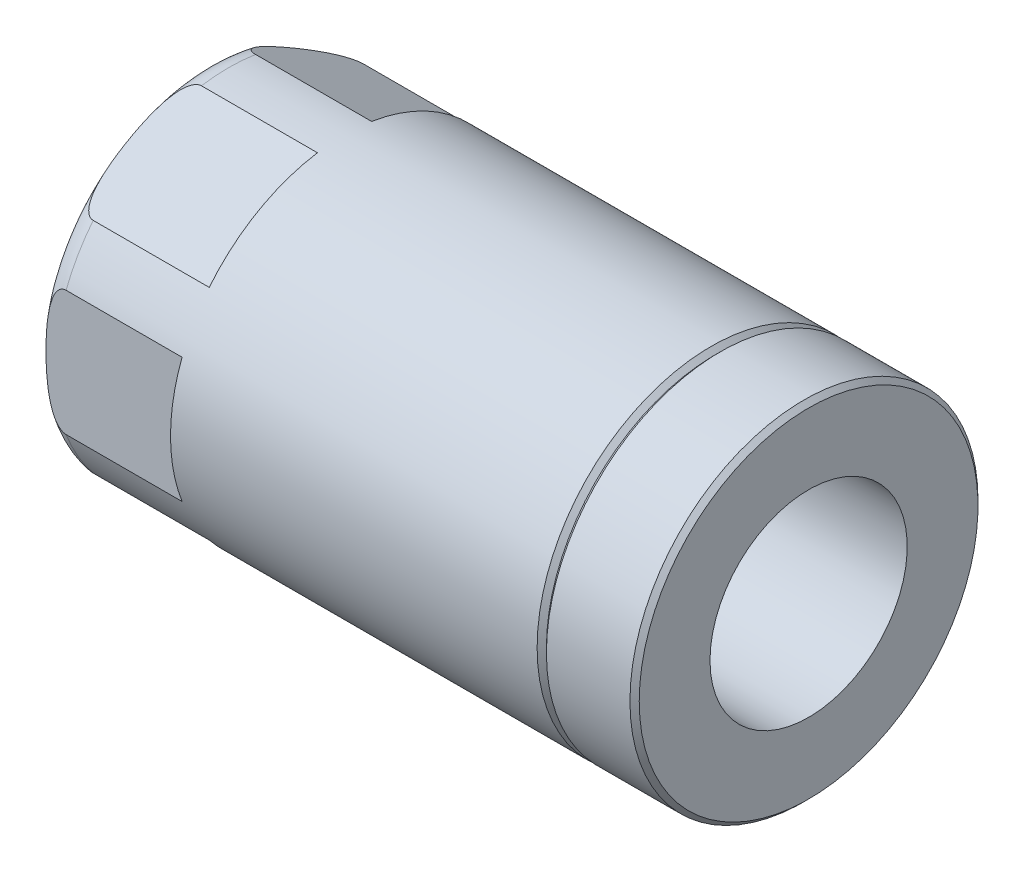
ISO-10303-21;
HEADER;
FILE_DESCRIPTION(('STEP AP214'),'2;1');
FILE_NAME('part.step','',(''),(''),'','','');
FILE_SCHEMA(('AUTOMOTIVE_DESIGN { 1 0 10303 214 1 1 1 1 }'));
ENDSEC;
DATA;
#1=APPLICATION_CONTEXT('core data for automotive mechanical design processes');
#2=APPLICATION_PROTOCOL_DEFINITION('international standard','automotive_design',2000,#1);
#3=PRODUCT_CONTEXT('',#1,'mechanical');
#4=PRODUCT('Part','Part','',(#3));
#5=PRODUCT_RELATED_PRODUCT_CATEGORY('part','',(#4));
#6=PRODUCT_DEFINITION_FORMATION('','',#4);
#7=PRODUCT_DEFINITION_CONTEXT('part definition',#1,'design');
#8=PRODUCT_DEFINITION('design','',#6,#7);
#9=PRODUCT_DEFINITION_SHAPE('','',#8);
#10=(LENGTH_UNIT() NAMED_UNIT(*) SI_UNIT(.MILLI.,.METRE.));
#11=(NAMED_UNIT(*) PLANE_ANGLE_UNIT() SI_UNIT($,.RADIAN.));
#12=(NAMED_UNIT(*) SI_UNIT($,.STERADIAN.) SOLID_ANGLE_UNIT());
#13=UNCERTAINTY_MEASURE_WITH_UNIT(LENGTH_MEASURE(1.E-05),#10,'distance_accuracy_value','');
#14=(GEOMETRIC_REPRESENTATION_CONTEXT(3) GLOBAL_UNCERTAINTY_ASSIGNED_CONTEXT((#13)) GLOBAL_UNIT_ASSIGNED_CONTEXT((#10,
#11,#12)) REPRESENTATION_CONTEXT('',''));
#15=CARTESIAN_POINT('',(0.,0.,0.));
#16=DIRECTION('',(0.,0.,1.));
#17=DIRECTION('',(1.,0.,0.));
#18=AXIS2_PLACEMENT_3D('',#15,#16,#17);
#19=CARTESIAN_POINT('',(26.,0.,0.));
#20=DIRECTION('',(-1.,0.,0.));
#21=DIRECTION('',(0.,0.,1.));
#22=AXIS2_PLACEMENT_3D('',#19,#20,#21);
#23=CYLINDRICAL_SURFACE('',#22,4.25);
#24=CARTESIAN_POINT('',(26.,0.,0.));
#25=DIRECTION('',(-1.,0.,0.));
#26=DIRECTION('',(0.,0.,1.));
#27=AXIS2_PLACEMENT_3D('',#24,#25,#26);
#28=CIRCLE('',#27,4.25);
#29=CARTESIAN_POINT('',(26.,0.,4.25));
#30=VERTEX_POINT('',#29);
#31=EDGE_CURVE('E466',#30,#30,#28,.F.);
#32=ORIENTED_EDGE('',*,*,#31,.T.);
#33=EDGE_LOOP('',(#32));
#34=FACE_BOUND('',#33,.T.);
#35=CARTESIAN_POINT('',(7.99999999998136,0.,0.));
#36=DIRECTION('',(1.,0.,0.));
#37=DIRECTION('',(0.,0.,-1.));
#38=AXIS2_PLACEMENT_3D('',#35,#36,#37);
#39=CIRCLE('',#38,4.2499999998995);
#40=CARTESIAN_POINT('',(7.99999999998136,0.,-4.2499999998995));
#41=VERTEX_POINT('',#40);
#42=EDGE_CURVE('E462',#41,#41,#39,.F.);
#43=ORIENTED_EDGE('',*,*,#42,.T.);
#44=EDGE_LOOP('',(#43));
#45=FACE_BOUND('',#44,.T.);
#46=ADVANCED_FACE('F17',(#34,#45),#23,.F.);
#47=CARTESIAN_POINT('',(26.,4.25,0.));
#48=DIRECTION('',(-1.,0.,0.));
#49=DIRECTION('',(0.,0.,1.));
#50=AXIS2_PLACEMENT_3D('',#47,#48,#49);
#51=PLANE('',#50);
#52=ORIENTED_EDGE('',*,*,#31,.F.);
#53=EDGE_LOOP('',(#52));
#54=FACE_BOUND('',#53,.T.);
#55=CARTESIAN_POINT('',(26.,0.,0.));
#56=DIRECTION('',(-1.,0.,0.));
#57=DIRECTION('',(0.,0.,1.));
#58=AXIS2_PLACEMENT_3D('',#55,#56,#57);
#59=CIRCLE('',#58,7.3);
#60=CARTESIAN_POINT('',(26.,0.,7.3));
#61=VERTEX_POINT('',#60);
#62=EDGE_CURVE('E465',#61,#61,#59,.T.);
#63=ORIENTED_EDGE('',*,*,#62,.F.);
#64=EDGE_LOOP('',(#63));
#65=FACE_BOUND('',#64,.T.);
#66=ADVANCED_FACE('F515',(#54,#65),#51,.F.);
#67=CARTESIAN_POINT('',(7.99999999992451,0.,0.));
#68=DIRECTION('',(1.,0.,0.));
#69=DIRECTION('',(0.,0.,-1.));
#70=AXIS2_PLACEMENT_3D('',#67,#68,#69);
#71=CONICAL_SURFACE('',#70,4.24999999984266,0.785398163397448);
#72=CARTESIAN_POINT('',(6.2085,0.,0.));
#73=DIRECTION('',(-1.,0.,0.));
#74=DIRECTION('',(0.,0.,1.));
#75=AXIS2_PLACEMENT_3D('',#72,#73,#74);
#76=CIRCLE('',#75,2.4585);
#77=CARTESIAN_POINT('',(6.2085,0.,2.4585));
#78=VERTEX_POINT('',#77);
#79=EDGE_CURVE('E467',#78,#78,#76,.T.);
#80=ORIENTED_EDGE('',*,*,#79,.T.);
#81=EDGE_LOOP('',(#80));
#82=FACE_BOUND('',#81,.T.);
#83=ORIENTED_EDGE('',*,*,#42,.F.);
#84=EDGE_LOOP('',(#83));
#85=FACE_BOUND('',#84,.T.);
#86=ADVANCED_FACE('F512',(#82,#85),#71,.F.);
#87=CARTESIAN_POINT('',(25.8,0.,0.));
#88=DIRECTION('',(-1.,0.,0.));
#89=DIRECTION('',(0.,0.,1.));
#90=AXIS2_PLACEMENT_3D('',#87,#88,#89);
#91=CONICAL_SURFACE('',#90,7.5,0.785398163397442);
#92=CARTESIAN_POINT('',(25.8,0.,0.));
#93=DIRECTION('',(-1.,0.,0.));
#94=DIRECTION('',(0.,0.,1.));
#95=AXIS2_PLACEMENT_3D('',#92,#93,#94);
#96=CIRCLE('',#95,7.5);
#97=CARTESIAN_POINT('',(25.8,0.,7.5));
#98=VERTEX_POINT('',#97);
#99=EDGE_CURVE('E470',#98,#98,#96,.T.);
#100=ORIENTED_EDGE('',*,*,#99,.F.);
#101=EDGE_LOOP('',(#100));
#102=FACE_BOUND('',#101,.T.);
#103=ORIENTED_EDGE('',*,*,#62,.T.);
#104=EDGE_LOOP('',(#103));
#105=FACE_BOUND('',#104,.T.);
#106=ADVANCED_FACE('F508',(#102,#105),#91,.T.);
#107=CARTESIAN_POINT('',(26.,0.,0.));
#108=DIRECTION('',(-1.,0.,0.));
#109=DIRECTION('',(0.,0.,1.));
#110=AXIS2_PLACEMENT_3D('',#107,#108,#109);
#111=CYLINDRICAL_SURFACE('',#110,2.4585);
#112=ORIENTED_EDGE('',*,*,#79,.F.);
#113=EDGE_LOOP('',(#112));
#114=FACE_BOUND('',#113,.T.);
#115=CARTESIAN_POINT('',(0.541499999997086,0.,0.));
#116=DIRECTION('',(-1.,0.,0.));
#117=DIRECTION('',(0.,0.,1.));
#118=AXIS2_PLACEMENT_3D('',#115,#116,#117);
#119=CIRCLE('',#118,2.45849999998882);
#120=CARTESIAN_POINT('',(0.541499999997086,0.,2.45849999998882));
#121=VERTEX_POINT('',#120);
#122=EDGE_CURVE('E473',#121,#121,#119,.T.);
#123=ORIENTED_EDGE('',*,*,#122,.T.);
#124=EDGE_LOOP('',(#123));
#125=FACE_BOUND('',#124,.T.);
#126=ADVANCED_FACE('F501',(#114,#125),#111,.F.);
#127=CARTESIAN_POINT('',(26.,0.,0.));
#128=DIRECTION('',(-1.,0.,0.));
#129=DIRECTION('',(0.,0.,1.));
#130=AXIS2_PLACEMENT_3D('',#127,#128,#129);
#131=CYLINDRICAL_SURFACE('',#130,7.5);
#132=CARTESIAN_POINT('',(22.2,0.,0.));
#133=DIRECTION('',(1.,0.,0.));
#134=DIRECTION('',(0.,0.,-1.));
#135=AXIS2_PLACEMENT_3D('',#132,#133,#134);
#136=CIRCLE('',#135,7.5);
#137=CARTESIAN_POINT('',(22.2,0.,-7.5));
#138=VERTEX_POINT('',#137);
#139=EDGE_CURVE('E475',#138,#138,#136,.F.);
#140=ORIENTED_EDGE('',*,*,#139,.F.);
#141=EDGE_LOOP('',(#140));
#142=FACE_BOUND('',#141,.T.);
#143=ORIENTED_EDGE('',*,*,#99,.T.);
#144=EDGE_LOOP('',(#143));
#145=FACE_BOUND('',#144,.T.);
#146=ADVANCED_FACE('F496',(#142,#145),#131,.T.);
#147=CARTESIAN_POINT('',(0.,0.,0.));
#148=DIRECTION('',(-1.,0.,0.));
#149=DIRECTION('',(0.,0.,1.));
#150=AXIS2_PLACEMENT_3D('',#147,#148,#149);
#151=CONICAL_SURFACE('',#150,2.9999999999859,0.785398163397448);
#152=ORIENTED_EDGE('',*,*,#122,.F.);
#153=EDGE_LOOP('',(#152));
#154=FACE_BOUND('',#153,.T.);
#155=CARTESIAN_POINT('',(0.,0.,0.));
#156=DIRECTION('',(-1.,0.,0.));
#157=DIRECTION('',(0.,0.,1.));
#158=AXIS2_PLACEMENT_3D('',#155,#156,#157);
#159=CIRCLE('',#158,2.9999999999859);
#160=CARTESIAN_POINT('',(0.,0.,2.9999999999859));
#161=VERTEX_POINT('',#160);
#162=EDGE_CURVE('E152',#161,#161,#159,.T.);
#163=ORIENTED_EDGE('',*,*,#162,.T.);
#164=EDGE_LOOP('',(#163));
#165=FACE_BOUND('',#164,.T.);
#166=ADVANCED_FACE('F492',(#154,#165),#151,.F.);
#167=CARTESIAN_POINT('',(22.2,0.,0.));
#168=DIRECTION('',(1.,0.,0.));
#169=DIRECTION('',(0.,0.,-1.));
#170=AXIS2_PLACEMENT_3D('',#167,#168,#169);
#171=CONICAL_SURFACE('',#170,7.5,0.78539816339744);
#172=ORIENTED_EDGE('',*,*,#139,.T.);
#173=EDGE_LOOP('',(#172));
#174=FACE_BOUND('',#173,.T.);
#175=CARTESIAN_POINT('',(22.,0.,0.));
#176=DIRECTION('',(-1.,0.,0.));
#177=DIRECTION('',(0.,0.,1.));
#178=AXIS2_PLACEMENT_3D('',#175,#176,#177);
#179=CIRCLE('',#178,7.3);
#180=CARTESIAN_POINT('',(22.,0.,7.3));
#181=VERTEX_POINT('',#180);
#182=EDGE_CURVE('E203',#181,#181,#179,.T.);
#183=ORIENTED_EDGE('',*,*,#182,.F.);
#184=EDGE_LOOP('',(#183));
#185=FACE_BOUND('',#184,.T.);
#186=ADVANCED_FACE('F185',(#174,#185),#171,.T.);
#187=CARTESIAN_POINT('',(0.,6.5,0.));
#188=DIRECTION('',(1.,0.,0.));
#189=DIRECTION('',(0.,0.,-1.));
#190=AXIS2_PLACEMENT_3D('',#187,#188,#189);
#191=PLANE('',#190);
#192=CARTESIAN_POINT('',(0.,0.,0.));
#193=DIRECTION('',(1.,0.,0.));
#194=DIRECTION('',(0.,0.,1.));
#195=AXIS2_PLACEMENT_3D('',#192,#193,#194);
#196=CIRCLE('',#195,6.5);
#197=CARTESIAN_POINT('',(0.,0.,6.5));
#198=VERTEX_POINT('',#197);
#199=CARTESIAN_POINT('',(0.,0.,-6.5));
#200=VERTEX_POINT('',#199);
#201=EDGE_CURVE('E167',#198,#200,#196,.T.);
#202=ORIENTED_EDGE('',*,*,#201,.F.);
#203=CARTESIAN_POINT('',(0.,0.,0.));
#204=DIRECTION('',(1.,0.,0.));
#205=DIRECTION('',(0.,0.,-1.));
#206=AXIS2_PLACEMENT_3D('',#203,#204,#205);
#207=CIRCLE('',#206,6.5);
#208=EDGE_CURVE('E199',#200,#198,#207,.T.);
#209=ORIENTED_EDGE('',*,*,#208,.F.);
#210=EDGE_LOOP('',(#202,#209));
#211=FACE_BOUND('',#210,.T.);
#212=ORIENTED_EDGE('',*,*,#162,.F.);
#213=EDGE_LOOP('',(#212));
#214=FACE_BOUND('',#213,.T.);
#215=ADVANCED_FACE('F174',(#211,#214),#191,.F.);
#216=CARTESIAN_POINT('',(6.,0.,0.));
#217=DIRECTION('',(1.,0.,0.));
#218=DIRECTION('',(0.,0.,-1.));
#219=AXIS2_PLACEMENT_3D('',#216,#217,#218);
#220=PLANE('',#219);
#221=CARTESIAN_POINT('',(6.,0.,0.));
#222=DIRECTION('',(-1.,0.,0.));
#223=DIRECTION('',(0.,0.,1.));
#224=AXIS2_PLACEMENT_3D('',#221,#222,#223);
#225=CIRCLE('',#224,7.5);
#226=CARTESIAN_POINT('',(6.,-4.71588662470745,5.8318447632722));
#227=VERTEX_POINT('',#226);
#228=CARTESIAN_POINT('',(6.,-7.4084690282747,1.16815523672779));
#229=VERTEX_POINT('',#228);
#230=EDGE_CURVE('E150',#227,#229,#225,.F.);
#231=ORIENTED_EDGE('',*,*,#230,.F.);
#232=DIRECTION('',(0.,0.5,0.866025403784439));
#233=VECTOR('',#232,1.);
#234=CARTESIAN_POINT('',(6.,-4.04145188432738,7.));
#235=LINE('',#234,#233);
#236=EDGE_CURVE('E143',#227,#229,#235,.F.);
#237=ORIENTED_EDGE('',*,*,#236,.T.);
#238=EDGE_LOOP('',(#231,#237));
#239=FACE_BOUND('',#238,.T.);
#240=ADVANCED_FACE('F184',(#239),#220,.F.);
#241=CARTESIAN_POINT('',(6.,-4.04145188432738,7.));
#242=DIRECTION('',(0.,0.866025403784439,-0.5));
#243=DIRECTION('',(0.,0.5,0.866025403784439));
#244=AXIS2_PLACEMENT_3D('',#241,#242,#243);
#245=PLANE('',#244);
#246=DIRECTION('',(-1.,0.,0.));
#247=VECTOR('',#246,1.);
#248=CARTESIAN_POINT('',(26.,-4.71588662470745,5.8318447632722));
#249=LINE('',#248,#247);
#250=CARTESIAN_POINT('',(0.999999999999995,-4.71588662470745,5.8318447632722));
#251=VERTEX_POINT('',#250);
#252=EDGE_CURVE('E153',#251,#227,#249,.F.);
#253=ORIENTED_EDGE('',*,*,#252,.F.);
#254=CARTESIAN_POINT('',(1.00000000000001,-7.4084690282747,1.1681552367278));
#255=CARTESIAN_POINT('',(0.988799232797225,-7.40847068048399,1.16815237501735));
#256=CARTESIAN_POINT('',(0.977604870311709,-7.40820674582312,1.16860952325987));
#257=CARTESIAN_POINT('',(0.955324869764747,-7.40716421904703,1.17041523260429));
#258=CARTESIAN_POINT('',(0.944239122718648,-7.40638621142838,1.17176278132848));
#259=CARTESIAN_POINT('',(0.911519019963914,-7.40332998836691,1.1770563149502));
#260=CARTESIAN_POINT('',(0.890144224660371,-7.40032867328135,1.18225474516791));
#261=CARTESIAN_POINT('',(0.844142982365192,-7.39182550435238,1.19698266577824));
#262=CARTESIAN_POINT('',(0.819820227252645,-7.38592181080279,1.20720816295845));
#263=CARTESIAN_POINT('',(0.773333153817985,-7.37221448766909,1.23094994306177));
#264=CARTESIAN_POINT('',(0.751179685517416,-7.36440192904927,1.24448169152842));
#265=CARTESIAN_POINT('',(0.697078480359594,-7.34254059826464,1.28234662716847));
#266=CARTESIAN_POINT('',(0.666781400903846,-7.32748167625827,1.30842944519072));
#267=CARTESIAN_POINT('',(0.610957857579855,-7.29533035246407,1.36411717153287));
#268=CARTESIAN_POINT('',(0.585440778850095,-7.27823405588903,1.3937288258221));
#269=CARTESIAN_POINT('',(0.538470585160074,-7.24289259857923,1.45494202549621));
#270=CARTESIAN_POINT('',(0.516990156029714,-7.2246563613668,1.48652811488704));
#271=CARTESIAN_POINT('',(0.4771483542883,-7.18734173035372,1.55115895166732));
#272=CARTESIAN_POINT('',(0.458790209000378,-7.16826249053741,1.58420516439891));
#273=CARTESIAN_POINT('',(0.424624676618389,-7.12949680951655,1.65134929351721));
#274=CARTESIAN_POINT('',(0.408823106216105,-7.1098091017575,1.68544940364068));
#275=CARTESIAN_POINT('',(0.379405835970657,-7.07004566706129,1.75432169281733));
#276=CARTESIAN_POINT('',(0.365789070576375,-7.04997013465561,1.7890935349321));
#277=CARTESIAN_POINT('',(0.32467060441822,-6.98453529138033,1.90243000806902));
#278=CARTESIAN_POINT('',(0.300816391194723,-6.93860314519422,1.98198681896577));
#279=CARTESIAN_POINT('',(0.259589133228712,-6.84595991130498,2.14244960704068));
#280=CARTESIAN_POINT('',(0.242229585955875,-6.79924740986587,2.2233580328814));
#281=CARTESIAN_POINT('',(0.212395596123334,-6.7053913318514,2.38592152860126));
#282=CARTESIAN_POINT('',(0.199926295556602,-6.65824735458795,2.46757729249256));
#283=CARTESIAN_POINT('',(0.178721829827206,-6.5634874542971,2.63170625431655));
#284=CARTESIAN_POINT('',(0.170008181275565,-6.51587037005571,2.7141814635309));
#285=CARTESIAN_POINT('',(0.155661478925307,-6.42058538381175,2.87921990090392));
#286=CARTESIAN_POINT('',(0.150024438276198,-6.37291762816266,2.96178287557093));
#287=CARTESIAN_POINT('',(0.141329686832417,-6.27754207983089,3.1269781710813));
#288=CARTESIAN_POINT('',(0.138271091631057,-6.22983430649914,3.20961045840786));
#289=CARTESIAN_POINT('',(0.13350822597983,-6.1109178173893,3.41557985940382));
#290=CARTESIAN_POINT('',(0.133210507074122,-6.03969415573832,3.53894286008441));
#291=CARTESIAN_POINT('',(0.137644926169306,-5.89724505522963,3.78567193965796));
#292=CARTESIAN_POINT('',(0.142380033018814,-5.82601964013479,3.9090379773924));
#293=CARTESIAN_POINT('',(0.157756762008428,-5.68414906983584,4.15476501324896));
#294=CARTESIAN_POINT('',(0.168361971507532,-5.61350303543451,4.27712753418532));
#295=CARTESIAN_POINT('',(0.19024825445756,-5.50786686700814,4.46009474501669));
#296=CARTESIAN_POINT('',(0.19853639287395,-5.47272177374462,4.52096783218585));
#297=CARTESIAN_POINT('',(0.217527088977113,-5.40259597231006,4.642429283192));
#298=CARTESIAN_POINT('',(0.228229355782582,-5.36761524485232,4.70301768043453));
#299=CARTESIAN_POINT('',(0.253385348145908,-5.29561289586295,4.82772940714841));
#300=CARTESIAN_POINT('',(0.268039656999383,-5.25860851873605,4.89182286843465));
#301=CARTESIAN_POINT('',(0.301641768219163,-5.18495954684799,5.01938662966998));
#302=CARTESIAN_POINT('',(0.320601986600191,-5.14831631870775,5.08285456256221));
#303=CARTESIAN_POINT('',(0.354983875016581,-5.09103788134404,5.18206372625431));
#304=CARTESIAN_POINT('',(0.368561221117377,-5.07012641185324,5.21828345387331));
#305=CARTESIAN_POINT('',(0.39795121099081,-5.02870248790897,5.29003179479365));
#306=CARTESIAN_POINT('',(0.413763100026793,-5.00818990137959,5.32556063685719));
#307=CARTESIAN_POINT('',(0.447998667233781,-4.9678129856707,5.39549550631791));
#308=CARTESIAN_POINT('',(0.466411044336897,-4.94794628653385,5.42990563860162));
#309=CARTESIAN_POINT('',(0.506482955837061,-4.90902856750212,5.49731310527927));
#310=CARTESIAN_POINT('',(0.528142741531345,-4.8899776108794,5.5303103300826));
#311=CARTESIAN_POINT('',(0.56979766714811,-4.8575546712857,5.58646850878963));
#312=CARTESIAN_POINT('',(0.588950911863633,-4.8439146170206,5.61009377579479));
#313=CARTESIAN_POINT('',(0.629959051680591,-4.81770589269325,5.65548861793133));
#314=CARTESIAN_POINT('',(0.651809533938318,-4.80513552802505,5.6772611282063));
#315=CARTESIAN_POINT('',(0.698984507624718,-4.78136907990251,5.71842582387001));
#316=CARTESIAN_POINT('',(0.724352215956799,-4.77019401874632,5.73778159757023));
#317=CARTESIAN_POINT('',(0.778629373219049,-4.75023628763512,5.77234940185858));
#318=CARTESIAN_POINT('',(0.807527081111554,-4.74144598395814,5.78757465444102));
#319=CARTESIAN_POINT('',(0.857771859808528,-4.72981901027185,5.80771316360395));
#320=CARTESIAN_POINT('',(0.878185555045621,-4.72597601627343,5.81436942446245));
#321=CARTESIAN_POINT('',(0.919994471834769,-4.72004816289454,5.82463676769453));
#322=CARTESIAN_POINT('',(0.94138687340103,-4.71795855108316,5.82825608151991));
#323=CARTESIAN_POINT('',(0.969106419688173,-4.71652468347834,5.83073961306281));
#324=CARTESIAN_POINT('',(0.975276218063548,-4.71628564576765,5.83115363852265));
#325=CARTESIAN_POINT('',(0.987629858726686,-4.71596676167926,5.83170596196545));
#326=CARTESIAN_POINT('',(0.99381369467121,-4.71588685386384,5.83184436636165));
#327=CARTESIAN_POINT('',(0.999999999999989,-4.71588662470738,5.83184476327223));
#328=B_SPLINE_CURVE_WITH_KNOTS('',3,(#254,#255,#256,#257,#258,#259,#260,#261,#262,#263,#264,
#265,#266,#267,#268,#269,#270,#271,#272,#273,#274,#275,#276,#277,#278,#279,#280,#281,#282,#283,
#284,#285,#286,#287,#288,#289,#290,#291,#292,#293,#294,#295,#296,#297,#298,#299,#300,#301,#302,
#303,#304,#305,#306,#307,#308,#309,#310,#311,#312,#313,#314,#315,#316,#317,#318,#319,#320,#321,
#322,#323,#324,#325,#326,#327),.UNSPECIFIED.,.F.,.F.,(4,2,2,2,2,2,2,2,2,2,2,2,2,2,2,2,2,2,2,2,2,
2,2,2,2,2,2,2,2,2,2,2,2,2,2,2,4),(0.,0.0335780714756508,0.067118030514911,0.133377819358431,
0.214046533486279,0.295100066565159,0.422540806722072,0.550229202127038,0.677019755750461,
0.803940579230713,0.931146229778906,1.0582896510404,1.3426272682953,1.62755256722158,
1.91277666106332,2.19961379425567,2.4860783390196,2.77244458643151,3.19969305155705,
3.62719368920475,4.05207175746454,4.26437145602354,4.47664558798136,4.7028940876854,
4.92980344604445,5.06166900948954,5.19349014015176,5.32475509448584,5.45603021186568,
5.55589257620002,5.65559367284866,5.75665111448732,5.8573811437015,5.92257044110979,
5.98758247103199,6.00614159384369,6.02469354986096),.UNSPECIFIED.);
#329=CARTESIAN_POINT('',(1.00000000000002,-7.4084690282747,1.16815523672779));
#330=VERTEX_POINT('',#329);
#331=EDGE_CURVE('E120',#330,#251,#328,.T.);
#332=ORIENTED_EDGE('',*,*,#331,.F.);
#333=DIRECTION('',(-1.,0.,0.));
#334=VECTOR('',#333,1.);
#335=CARTESIAN_POINT('',(26.,-7.4084690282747,1.16815523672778));
#336=LINE('',#335,#334);
#337=EDGE_CURVE('E147',#229,#330,#336,.T.);
#338=ORIENTED_EDGE('',*,*,#337,.F.);
#339=ORIENTED_EDGE('',*,*,#236,.F.);
#340=EDGE_LOOP('',(#253,#332,#338,#339));
#341=FACE_BOUND('',#340,.T.);
#342=ADVANCED_FACE('F317',(#341),#245,.F.);
#343=CARTESIAN_POINT('',(6.,0.,0.));
#344=DIRECTION('',(1.,0.,0.));
#345=DIRECTION('',(0.,0.,-1.));
#346=AXIS2_PLACEMENT_3D('',#343,#344,#345);
#347=PLANE('',#346);
#348=CARTESIAN_POINT('',(6.,0.,0.));
#349=DIRECTION('',(-1.,0.,0.));
#350=DIRECTION('',(0.,0.,1.));
#351=AXIS2_PLACEMENT_3D('',#348,#349,#350);
#352=CIRCLE('',#351,7.5);
#353=CARTESIAN_POINT('',(6.,-7.4084690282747,-1.1681552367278));
#354=VERTEX_POINT('',#353);
#355=CARTESIAN_POINT('',(6.,-4.71588662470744,-5.8318447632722));
#356=VERTEX_POINT('',#355);
#357=EDGE_CURVE('E136',#354,#356,#352,.F.);
#358=ORIENTED_EDGE('',*,*,#357,.F.);
#359=DIRECTION('',(0.,-0.5,0.866025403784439));
#360=VECTOR('',#359,1.);
#361=CARTESIAN_POINT('',(6.,-8.08290376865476,0.));
#362=LINE('',#361,#360);
#363=EDGE_CURVE('E121',#354,#356,#362,.F.);
#364=ORIENTED_EDGE('',*,*,#363,.T.);
#365=EDGE_LOOP('',(#358,#364));
#366=FACE_BOUND('',#365,.T.);
#367=ADVANCED_FACE('F325',(#366),#347,.F.);
#368=CARTESIAN_POINT('',(6.,-8.08290376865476,0.));
#369=DIRECTION('',(0.,0.866025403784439,0.5));
#370=DIRECTION('',(0.,-0.5,0.866025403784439));
#371=AXIS2_PLACEMENT_3D('',#368,#369,#370);
#372=PLANE('',#371);
#373=DIRECTION('',(-1.,0.,0.));
#374=VECTOR('',#373,1.);
#375=CARTESIAN_POINT('',(26.,-7.40846902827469,-1.1681552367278));
#376=LINE('',#375,#374);
#377=CARTESIAN_POINT('',(1.00000000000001,-7.4084690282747,-1.1681552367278));
#378=VERTEX_POINT('',#377);
#379=EDGE_CURVE('E116',#378,#354,#376,.F.);
#380=ORIENTED_EDGE('',*,*,#379,.F.);
#381=CARTESIAN_POINT('',(1.00000000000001,-4.71588662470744,-5.8318447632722));
#382=CARTESIAN_POINT('',(0.988799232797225,-4.71588497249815,-5.83184762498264));
#383=CARTESIAN_POINT('',(0.977604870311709,-4.71614890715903,-5.83139047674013));
#384=CARTESIAN_POINT('',(0.955324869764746,-4.71719143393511,-5.82958476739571));
#385=CARTESIAN_POINT('',(0.944239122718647,-4.71796944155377,-5.82823721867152));
#386=CARTESIAN_POINT('',(0.911519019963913,-4.72102566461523,-5.8229436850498));
#387=CARTESIAN_POINT('',(0.890144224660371,-4.72402697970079,-5.81774525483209));
#388=CARTESIAN_POINT('',(0.844142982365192,-4.73253014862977,-5.80301733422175));
#389=CARTESIAN_POINT('',(0.819820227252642,-4.73843384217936,-5.79279183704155));
#390=CARTESIAN_POINT('',(0.773333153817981,-4.75214116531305,-5.76905005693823));
#391=CARTESIAN_POINT('',(0.751179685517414,-4.75995372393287,-5.75551830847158));
#392=CARTESIAN_POINT('',(0.697078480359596,-4.78181505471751,-5.71765337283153));
#393=CARTESIAN_POINT('',(0.66678140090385,-4.79687397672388,-5.69157055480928));
#394=CARTESIAN_POINT('',(0.610957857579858,-4.82902530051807,-5.63588282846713));
#395=CARTESIAN_POINT('',(0.585440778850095,-4.84612159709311,-5.6062711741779));
#396=CARTESIAN_POINT('',(0.538470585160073,-4.88146305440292,-5.54505797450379));
#397=CARTESIAN_POINT('',(0.516990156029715,-4.89969929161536,-5.51347188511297));
#398=CARTESIAN_POINT('',(0.477148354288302,-4.9370139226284,-5.44884104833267));
#399=CARTESIAN_POINT('',(0.458790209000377,-4.95609316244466,-5.41579483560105));
#400=CARTESIAN_POINT('',(0.424624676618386,-4.99485884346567,-5.34865070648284));
#401=CARTESIAN_POINT('',(0.408823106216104,-5.01454655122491,-5.31455059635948));
#402=CARTESIAN_POINT('',(0.379405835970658,-5.05430998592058,-5.24567830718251));
#403=CARTESIAN_POINT('',(0.365789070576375,-5.07438551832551,-5.2109064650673));
#404=CARTESIAN_POINT('',(0.32467060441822,-5.13982036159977,-5.0975699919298));
#405=CARTESIAN_POINT('',(0.300816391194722,-5.18575250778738,-5.01801318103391));
#406=CARTESIAN_POINT('',(0.259589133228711,-5.27839574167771,-4.85755039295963));
#407=CARTESIAN_POINT('',(0.242229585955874,-5.32510824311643,-4.77664196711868));
#408=CARTESIAN_POINT('',(0.212395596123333,-5.4189643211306,-4.61407847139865));
#409=CARTESIAN_POINT('',(0.199926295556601,-5.46610829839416,-4.5324227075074));
#410=CARTESIAN_POINT('',(0.178721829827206,-5.56086819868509,-4.36829374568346));
#411=CARTESIAN_POINT('',(0.170008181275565,-5.60848528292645,-4.28581853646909));
#412=CARTESIAN_POINT('',(0.155661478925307,-5.70377026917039,-4.12078009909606));
#413=CARTESIAN_POINT('',(0.150024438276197,-5.75143802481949,-4.03821712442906));
#414=CARTESIAN_POINT('',(0.141329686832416,-5.84681357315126,-3.87302182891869));
#415=CARTESIAN_POINT('',(0.138271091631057,-5.89452134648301,-3.79038954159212));
#416=CARTESIAN_POINT('',(0.13350822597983,-6.01343783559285,-3.58442014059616));
#417=CARTESIAN_POINT('',(0.133210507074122,-6.08466149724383,-3.46105713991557));
#418=CARTESIAN_POINT('',(0.137644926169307,-6.22711059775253,-3.21432806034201));
#419=CARTESIAN_POINT('',(0.142380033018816,-6.29833601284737,-3.09096202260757));
#420=CARTESIAN_POINT('',(0.157756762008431,-6.44020658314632,-2.84523498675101));
#421=CARTESIAN_POINT('',(0.168361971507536,-6.51085261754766,-2.72287246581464));
#422=CARTESIAN_POINT('',(0.190248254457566,-6.61648878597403,-2.53990525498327));
#423=CARTESIAN_POINT('',(0.198536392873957,-6.65163387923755,-2.47903216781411));
#424=CARTESIAN_POINT('',(0.217527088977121,-6.72175968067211,-2.35757071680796));
#425=CARTESIAN_POINT('',(0.228229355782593,-6.75674040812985,-2.29698231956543));
#426=CARTESIAN_POINT('',(0.25338534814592,-6.82874275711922,-2.17227059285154));
#427=CARTESIAN_POINT('',(0.268039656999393,-6.86574713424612,-2.10817713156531));
#428=CARTESIAN_POINT('',(0.301641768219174,-6.93939610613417,-1.98061337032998));
#429=CARTESIAN_POINT('',(0.320601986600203,-6.97603933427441,-1.91714543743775));
#430=CARTESIAN_POINT('',(0.354983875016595,-7.03331777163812,-1.81793627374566));
#431=CARTESIAN_POINT('',(0.36856122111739,-7.05422924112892,-1.78171654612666));
#432=CARTESIAN_POINT('',(0.397951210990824,-7.09565316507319,-1.70996820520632));
#433=CARTESIAN_POINT('',(0.413763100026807,-7.11616575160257,-1.67443936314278));
#434=CARTESIAN_POINT('',(0.447998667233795,-7.15654266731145,-1.60450449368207));
#435=CARTESIAN_POINT('',(0.466411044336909,-7.1764093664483,-1.57009436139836));
#436=CARTESIAN_POINT('',(0.506482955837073,-7.21532708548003,-1.50268689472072));
#437=CARTESIAN_POINT('',(0.528142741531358,-7.23437804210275,-1.46968966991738));
#438=CARTESIAN_POINT('',(0.569797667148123,-7.26680098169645,-1.41353149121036));
#439=CARTESIAN_POINT('',(0.588950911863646,-7.28044103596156,-1.3899062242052));
#440=CARTESIAN_POINT('',(0.629959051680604,-7.3066497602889,-1.34451138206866));
#441=CARTESIAN_POINT('',(0.651809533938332,-7.31922012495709,-1.32273887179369));
#442=CARTESIAN_POINT('',(0.698984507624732,-7.34298657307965,-1.28157417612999));
#443=CARTESIAN_POINT('',(0.724352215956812,-7.35416163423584,-1.26221840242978));
#444=CARTESIAN_POINT('',(0.778629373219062,-7.374119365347,-1.2276505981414));
#445=CARTESIAN_POINT('',(0.807527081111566,-7.38290966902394,-1.21242534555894));
#446=CARTESIAN_POINT('',(0.857771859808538,-7.39453664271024,-1.19228683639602));
#447=CARTESIAN_POINT('',(0.878185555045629,-7.3983796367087,-1.18563057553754));
#448=CARTESIAN_POINT('',(0.919994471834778,-7.40430749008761,-1.17536323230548));
#449=CARTESIAN_POINT('',(0.94138687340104,-7.40639710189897,-1.17174391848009));
#450=CARTESIAN_POINT('',(0.969106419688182,-7.40783096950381,-1.1692603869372));
#451=CARTESIAN_POINT('',(0.975276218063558,-7.4080700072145,-1.16884636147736));
#452=CARTESIAN_POINT('',(0.987629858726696,-7.40838889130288,-1.16829403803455));
#453=CARTESIAN_POINT('',(0.993813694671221,-7.40846879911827,-1.16815563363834));
#454=CARTESIAN_POINT('',(1.,-7.40846902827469,-1.16815523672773));
#455=B_SPLINE_CURVE_WITH_KNOTS('',3,(#381,#382,#383,#384,#385,#386,#387,#388,#389,#390,#391,
#392,#393,#394,#395,#396,#397,#398,#399,#400,#401,#402,#403,#404,#405,#406,#407,#408,#409,#410,
#411,#412,#413,#414,#415,#416,#417,#418,#419,#420,#421,#422,#423,#424,#425,#426,#427,#428,#429,
#430,#431,#432,#433,#434,#435,#436,#437,#438,#439,#440,#441,#442,#443,#444,#445,#446,#447,#448,
#449,#450,#451,#452,#453,#454),.UNSPECIFIED.,.F.,.F.,(4,2,2,2,2,2,2,2,2,2,2,2,2,2,2,2,2,2,2,2,2,
2,2,2,2,2,2,2,2,2,2,2,2,2,2,2,4),(0.,0.0335780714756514,0.0671180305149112,0.133377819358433,
0.214046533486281,0.295100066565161,0.422540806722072,0.550229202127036,0.67701975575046,
0.803940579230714,0.931146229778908,1.05828965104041,1.34262726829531,1.62755256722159,
1.91277666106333,2.19961379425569,2.48607833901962,2.77244458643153,3.19969305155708,
3.62719368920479,4.05207175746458,4.26437145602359,4.47664558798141,4.70289408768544,
4.92980344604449,5.06166900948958,5.19349014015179,5.32475509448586,5.4560302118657,
5.55589257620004,5.65559367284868,5.75665111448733,5.85738114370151,5.9225704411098,
5.98758247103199,6.0061415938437,6.02469354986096),.UNSPECIFIED.);
#456=CARTESIAN_POINT('',(1.00000000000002,-4.71588662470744,-5.8318447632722));
#457=VERTEX_POINT('',#456);
#458=EDGE_CURVE('E109',#457,#378,#455,.T.);
#459=ORIENTED_EDGE('',*,*,#458,.F.);
#460=DIRECTION('',(-1.,0.,0.));
#461=VECTOR('',#460,1.);
#462=CARTESIAN_POINT('',(26.,-4.71588662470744,-5.83184476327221));
#463=LINE('',#462,#461);
#464=EDGE_CURVE('E113',#356,#457,#463,.T.);
#465=ORIENTED_EDGE('',*,*,#464,.F.);
#466=ORIENTED_EDGE('',*,*,#363,.F.);
#467=EDGE_LOOP('',(#380,#459,#465,#466));
#468=FACE_BOUND('',#467,.T.);
#469=ADVANCED_FACE('F111',(#468),#372,.F.);
#470=CARTESIAN_POINT('',(21.8,0.,0.));
#471=DIRECTION('',(-1.,0.,0.));
#472=DIRECTION('',(0.,0.,1.));
#473=AXIS2_PLACEMENT_3D('',#470,#471,#472);
#474=CONICAL_SURFACE('',#473,7.5,0.785398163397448);
#475=CARTESIAN_POINT('',(21.8,0.,0.));
#476=DIRECTION('',(-1.,0.,0.));
#477=DIRECTION('',(0.,0.,1.));
#478=AXIS2_PLACEMENT_3D('',#475,#476,#477);
#479=CIRCLE('',#478,7.5);
#480=CARTESIAN_POINT('',(21.8,0.,7.5));
#481=VERTEX_POINT('',#480);
#482=EDGE_CURVE('E259',#481,#481,#479,.T.);
#483=ORIENTED_EDGE('',*,*,#482,.F.);
#484=EDGE_LOOP('',(#483));
#485=FACE_BOUND('',#484,.T.);
#486=ORIENTED_EDGE('',*,*,#182,.T.);
#487=EDGE_LOOP('',(#486));
#488=FACE_BOUND('',#487,.T.);
#489=ADVANCED_FACE('F321',(#485,#488),#474,.T.);
#490=CARTESIAN_POINT('',(6.,0.,0.));
#491=DIRECTION('',(1.,0.,0.));
#492=DIRECTION('',(0.,0.,-1.));
#493=AXIS2_PLACEMENT_3D('',#490,#491,#492);
#494=PLANE('',#493);
#495=CARTESIAN_POINT('',(6.,0.,0.));
#496=DIRECTION('',(-1.,0.,0.));
#497=DIRECTION('',(0.,0.,1.));
#498=AXIS2_PLACEMENT_3D('',#495,#496,#497);
#499=CIRCLE('',#498,7.5);
#500=CARTESIAN_POINT('',(6.,-2.69258240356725,-7.));
#501=VERTEX_POINT('',#500);
#502=CARTESIAN_POINT('',(6.,2.69258240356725,-7.));
#503=VERTEX_POINT('',#502);
#504=EDGE_CURVE('E257',#501,#503,#499,.F.);
#505=ORIENTED_EDGE('',*,*,#504,.F.);
#506=DIRECTION('',(0.,1.,0.));
#507=VECTOR('',#506,1.);
#508=CARTESIAN_POINT('',(6.,-4.04145188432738,-7.));
#509=LINE('',#508,#507);
#510=EDGE_CURVE('E247',#501,#503,#509,.T.);
#511=ORIENTED_EDGE('',*,*,#510,.T.);
#512=EDGE_LOOP('',(#505,#511));
#513=FACE_BOUND('',#512,.T.);
#514=ADVANCED_FACE('F268',(#513),#494,.F.);
#515=CARTESIAN_POINT('',(6.,-4.04145188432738,-7.));
#516=DIRECTION('',(0.,0.,1.));
#517=DIRECTION('',(1.,0.,0.));
#518=AXIS2_PLACEMENT_3D('',#515,#516,#517);
#519=PLANE('',#518);
#520=DIRECTION('',(-1.,0.,0.));
#521=VECTOR('',#520,1.);
#522=CARTESIAN_POINT('',(26.,-2.69258240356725,-7.));
#523=LINE('',#522,#521);
#524=CARTESIAN_POINT('',(1.00000000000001,-2.69258240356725,-7.));
#525=VERTEX_POINT('',#524);
#526=EDGE_CURVE('E131',#525,#501,#523,.F.);
#527=ORIENTED_EDGE('',*,*,#526,.F.);
#528=CARTESIAN_POINT('',(0.999999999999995,2.69258240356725,-7.));
#529=CARTESIAN_POINT('',(0.98879918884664,2.69258570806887,-7.));
#530=CARTESIAN_POINT('',(0.977604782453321,2.69205783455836,-7.));
#531=CARTESIAN_POINT('',(0.955324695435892,2.68997276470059,-7.));
#532=CARTESIAN_POINT('',(0.944238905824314,2.68841673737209,-7.));
#533=CARTESIAN_POINT('',(0.911518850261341,2.68230427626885,-7.));
#534=CARTESIAN_POINT('',(0.89014414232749,2.67630166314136,-7.));
#535=CARTESIAN_POINT('',(0.844143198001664,2.65929543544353,-7.));
#536=CARTESIAN_POINT('',(0.819820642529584,2.64748817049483,-7.));
#537=CARTESIAN_POINT('',(0.773333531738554,2.62007358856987,-7.));
#538=CARTESIAN_POINT('',(0.751179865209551,2.60444834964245,-7.));
#539=CARTESIAN_POINT('',(0.697077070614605,2.56072440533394,-7.));
#540=CARTESIAN_POINT('',(0.666778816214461,2.5306051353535,-7.));
#541=CARTESIAN_POINT('',(0.610955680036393,2.46630212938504,-7.));
#542=CARTESIAN_POINT('',(0.585439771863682,2.4321109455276,-6.99999999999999));
#543=CARTESIAN_POINT('',(0.538476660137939,2.36143868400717,-7.));
#544=CARTESIAN_POINT('',(0.517001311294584,2.32497599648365,-7.00000000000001));
#545=CARTESIAN_POINT('',(0.477168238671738,2.25036702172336,-6.99999999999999));
#546=CARTESIAN_POINT('',(0.458813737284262,2.21221904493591,-6.99999999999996));
#547=CARTESIAN_POINT('',(0.424645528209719,2.13468896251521,-7.00000000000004));
#548=CARTESIAN_POINT('',(0.408838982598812,2.0953037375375,-7.00000000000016));
#549=CARTESIAN_POINT('',(0.379412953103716,2.01575664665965,-6.99999999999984));
#550=CARTESIAN_POINT('',(0.365792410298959,1.97559516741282,-6.99999999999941));
#551=CARTESIAN_POINT('',(0.32461099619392,1.84452538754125,-6.99999999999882));
#552=CARTESIAN_POINT('',(0.300716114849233,1.75246560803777,-6.99999999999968));
#553=CARTESIAN_POINT('',(0.259430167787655,1.56678396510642,-7.00000000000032));
#554=CARTESIAN_POINT('',(0.242052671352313,1.47315926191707,-7.00000000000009));
#555=CARTESIAN_POINT('',(0.212198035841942,1.285049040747,-6.99999999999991));
#556=CARTESIAN_POINT('',(0.199725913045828,1.19056274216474,-6.99999999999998));
#557=CARTESIAN_POINT('',(0.178570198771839,1.00104531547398,-7.00000000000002));
#558=CARTESIAN_POINT('',(0.169892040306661,0.906013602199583,-7.00000000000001));
#559=CARTESIAN_POINT('',(0.155601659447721,0.715847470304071,-6.99999999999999));
#560=CARTESIAN_POINT('',(0.149985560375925,0.620713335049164,-7.));
#561=CARTESIAN_POINT('',(0.141316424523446,0.430350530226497,-7.));
#562=CARTESIAN_POINT('',(0.138262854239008,0.335121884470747,-7.));
#563=CARTESIAN_POINT('',(0.135561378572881,0.199911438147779,-7.));
#564=CARTESIAN_POINT('',(0.134965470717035,0.15994628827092,-7.));
#565=CARTESIAN_POINT('',(0.134172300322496,0.0799876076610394,-7.));
#566=CARTESIAN_POINT('',(0.133975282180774,0.0399940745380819,-7.));
#567=CARTESIAN_POINT('',(0.133972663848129,-0.112663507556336,-7.));
#568=CARTESIAN_POINT('',(0.135528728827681,-0.225331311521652,-7.));
#569=CARTESIAN_POINT('',(0.141938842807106,-0.450605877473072,-7.));
#570=CARTESIAN_POINT('',(0.146793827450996,-0.563212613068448,-7.00000000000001));
#571=CARTESIAN_POINT('',(0.160407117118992,-0.788434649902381,-6.99999999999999));
#572=CARTESIAN_POINT('',(0.16917343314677,-0.901049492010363,-6.99999999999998));
#573=CARTESIAN_POINT('',(0.191610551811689,-1.12504429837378,-7.00000000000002));
#574=CARTESIAN_POINT('',(0.205248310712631,-1.23642749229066,-7.00000000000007));
#575=CARTESIAN_POINT('',(0.239083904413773,-1.45807302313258,-6.99999999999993));
#576=CARTESIAN_POINT('',(0.259270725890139,-1.56833692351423,-6.99999999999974));
#577=CARTESIAN_POINT('',(0.296484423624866,-1.73200129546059,-7.00000000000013));
#578=CARTESIAN_POINT('',(0.310021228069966,-1.78619422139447,-7.00000000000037));
#579=CARTESIAN_POINT('',(0.339913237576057,-1.89379029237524,-6.99999999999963));
#580=CARTESIAN_POINT('',(0.356267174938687,-1.94719378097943,-6.99999999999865));
#581=CARTESIAN_POINT('',(0.382485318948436,-2.02372543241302,-6.99999999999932));
#582=CARTESIAN_POINT('',(0.39096366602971,-2.04733029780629,-6.99999999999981));
#583=CARTESIAN_POINT('',(0.408701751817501,-2.09424803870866,-7.00000000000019));
#584=CARTESIAN_POINT('',(0.417961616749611,-2.11756086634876,-7.00000000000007));
#585=CARTESIAN_POINT('',(0.44706669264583,-2.18703269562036,-6.99999999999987));
#586=CARTESIAN_POINT('',(0.468216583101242,-2.23266273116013,-6.99999999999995));
#587=CARTESIAN_POINT('',(0.515021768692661,-2.32201388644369,-7.00000000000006));
#588=CARTESIAN_POINT('',(0.540709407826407,-2.36571828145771,-7.00000000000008));
#589=CARTESIAN_POINT('',(0.597677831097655,-2.44933428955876,-6.99999999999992));
#590=CARTESIAN_POINT('',(0.628942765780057,-2.48925617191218,-6.99999999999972));
#591=CARTESIAN_POINT('',(0.682404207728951,-2.54548103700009,-6.99999999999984));
#592=CARTESIAN_POINT('',(0.702089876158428,-2.56415666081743,-6.99999999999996));
#593=CARTESIAN_POINT('',(0.743731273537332,-2.59886384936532,-7.00000000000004));
#594=CARTESIAN_POINT('',(0.765688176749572,-2.61489403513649,-7.00000000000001));
#595=CARTESIAN_POINT('',(0.812236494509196,-2.64349979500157,-6.99999999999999));
#596=CARTESIAN_POINT('',(0.836861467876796,-2.65602195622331,-7.));
#597=CARTESIAN_POINT('',(0.888067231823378,-2.67597305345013,-7.));
#598=CARTESIAN_POINT('',(0.914639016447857,-2.68342398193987,-7.));
#599=CARTESIAN_POINT('',(0.951300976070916,-2.68940819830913,-7.));
#600=CARTESIAN_POINT('',(0.960995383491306,-2.69059467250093,-7.));
#601=CARTESIAN_POINT('',(0.98045770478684,-2.69218222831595,-7.));
#602=CARTESIAN_POINT('',(0.990225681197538,-2.69258254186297,-7.));
#603=CARTESIAN_POINT('',(1.00000000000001,-2.69258240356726,-7.));
#604=B_SPLINE_CURVE_WITH_KNOTS('',3,(#528,#529,#530,#531,#532,#533,#534,#535,#536,#537,#538,
#539,#540,#541,#542,#543,#544,#545,#546,#547,#548,#549,#550,#551,#552,#553,#554,#555,#556,#557,
#558,#559,#560,#561,#562,#563,#564,#565,#566,#567,#568,#569,#570,#571,#572,#573,#574,#575,#576,
#577,#578,#579,#580,#581,#582,#583,#584,#585,#586,#587,#588,#589,#590,#591,#592,#593,#594,#595,
#596,#597,#598,#599,#600,#601,#602,#603),.UNSPECIFIED.,.F.,.F.,(4,2,2,2,2,2,2,2,2,2,2,2,2,2,2,2,
2,2,2,2,2,2,2,2,2,2,2,2,2,2,2,2,2,2,2,2,2,4),(0.,0.0335782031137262,0.0671182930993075,
0.133377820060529,0.214045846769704,0.295100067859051,0.422546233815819,0.55022919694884,
0.67698686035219,0.803874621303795,0.931113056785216,1.05828966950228,1.34322328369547,
1.62874688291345,1.91456170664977,2.20078449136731,2.48664406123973,2.77244410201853,
2.89235131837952,3.01233197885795,3.35031809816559,3.68840011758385,4.02717778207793,
4.36369979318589,4.69965879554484,4.86717853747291,5.0346230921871,5.10985465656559,
5.18509839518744,5.33578253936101,5.48758757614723,5.63896789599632,5.72020367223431,
5.80148166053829,5.88393715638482,5.96603274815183,5.99530671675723,6.02460927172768),.UNSPECIFIED.);
#605=CARTESIAN_POINT('',(0.999999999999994,2.69258240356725,-7.));
#606=VERTEX_POINT('',#605);
#607=EDGE_CURVE('E127',#606,#525,#604,.T.);
#608=ORIENTED_EDGE('',*,*,#607,.F.);
#609=DIRECTION('',(-1.,0.,0.));
#610=VECTOR('',#609,1.);
#611=CARTESIAN_POINT('',(26.,2.69258240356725,-7.));
#612=LINE('',#611,#610);
#613=EDGE_CURVE('E254',#503,#606,#612,.T.);
#614=ORIENTED_EDGE('',*,*,#613,.F.);
#615=ORIENTED_EDGE('',*,*,#510,.F.);
#616=EDGE_LOOP('',(#527,#608,#614,#615));
#617=FACE_BOUND('',#616,.T.);
#618=ADVANCED_FACE('F265',(#617),#519,.F.);
#619=CARTESIAN_POINT('',(6.,0.,0.));
#620=DIRECTION('',(1.,0.,0.));
#621=DIRECTION('',(0.,0.,-1.));
#622=AXIS2_PLACEMENT_3D('',#619,#620,#621);
#623=PLANE('',#622);
#624=CARTESIAN_POINT('',(6.,0.,0.));
#625=DIRECTION('',(-1.,0.,0.));
#626=DIRECTION('',(0.,0.,1.));
#627=AXIS2_PLACEMENT_3D('',#624,#625,#626);
#628=CIRCLE('',#627,7.5);
#629=CARTESIAN_POINT('',(6.,4.71588662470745,-5.8318447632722));
#630=VERTEX_POINT('',#629);
#631=CARTESIAN_POINT('',(6.,7.4084690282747,-1.16815523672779));
#632=VERTEX_POINT('',#631);
#633=EDGE_CURVE('E245',#630,#632,#628,.F.);
#634=ORIENTED_EDGE('',*,*,#633,.F.);
#635=DIRECTION('',(0.,-0.5,-0.866025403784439));
#636=VECTOR('',#635,1.);
#637=CARTESIAN_POINT('',(6.,4.04145188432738,-7.));
#638=LINE('',#637,#636);
#639=EDGE_CURVE('E235',#630,#632,#638,.F.);
#640=ORIENTED_EDGE('',*,*,#639,.T.);
#641=EDGE_LOOP('',(#634,#640));
#642=FACE_BOUND('',#641,.T.);
#643=ADVANCED_FACE('F295',(#642),#623,.F.);
#644=CARTESIAN_POINT('',(6.,4.04145188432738,-7.));
#645=DIRECTION('',(0.,-0.866025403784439,0.5));
#646=DIRECTION('',(0.,-0.5,-0.866025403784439));
#647=AXIS2_PLACEMENT_3D('',#644,#645,#646);
#648=PLANE('',#647);
#649=DIRECTION('',(-1.,0.,0.));
#650=VECTOR('',#649,1.);
#651=CARTESIAN_POINT('',(26.,4.71588662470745,-5.8318447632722));
#652=LINE('',#651,#650);
#653=CARTESIAN_POINT('',(0.999999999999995,4.71588662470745,-5.8318447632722));
#654=VERTEX_POINT('',#653);
#655=EDGE_CURVE('E248',#654,#630,#652,.F.);
#656=ORIENTED_EDGE('',*,*,#655,.F.);
#657=CARTESIAN_POINT('',(1.00000000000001,7.4084690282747,-1.1681552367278));
#658=CARTESIAN_POINT('',(0.988799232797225,7.40847068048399,-1.16815237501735));
#659=CARTESIAN_POINT('',(0.977604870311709,7.40820674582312,-1.16860952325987));
#660=CARTESIAN_POINT('',(0.955324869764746,7.40716421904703,-1.17041523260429));
#661=CARTESIAN_POINT('',(0.944239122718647,7.40638621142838,-1.17176278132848));
#662=CARTESIAN_POINT('',(0.911519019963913,7.40332998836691,-1.1770563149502));
#663=CARTESIAN_POINT('',(0.89014422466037,7.40032867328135,-1.18225474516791));
#664=CARTESIAN_POINT('',(0.844142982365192,7.39182550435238,-1.19698266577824));
#665=CARTESIAN_POINT('',(0.819820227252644,7.38592181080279,-1.20720816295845));
#666=CARTESIAN_POINT('',(0.773333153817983,7.37221448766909,-1.23094994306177));
#667=CARTESIAN_POINT('',(0.751179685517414,7.36440192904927,-1.24448169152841));
#668=CARTESIAN_POINT('',(0.697078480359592,7.34254059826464,-1.28234662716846));
#669=CARTESIAN_POINT('',(0.666781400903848,7.32748167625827,-1.30842944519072));
#670=CARTESIAN_POINT('',(0.610957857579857,7.29533035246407,-1.36411717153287));
#671=CARTESIAN_POINT('',(0.585440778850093,7.27823405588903,-1.3937288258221));
#672=CARTESIAN_POINT('',(0.53847058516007,7.24289259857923,-1.45494202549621));
#673=CARTESIAN_POINT('',(0.516990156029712,7.2246563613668,-1.48652811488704));
#674=CARTESIAN_POINT('',(0.477148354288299,7.18734173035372,-1.55115895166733));
#675=CARTESIAN_POINT('',(0.458790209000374,7.16826249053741,-1.58420516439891));
#676=CARTESIAN_POINT('',(0.424624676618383,7.12949680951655,-1.65134929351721));
#677=CARTESIAN_POINT('',(0.4088231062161,7.1098091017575,-1.68544940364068));
#678=CARTESIAN_POINT('',(0.379405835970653,7.07004566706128,-1.75432169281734));
#679=CARTESIAN_POINT('',(0.365789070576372,7.0499701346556,-1.78909353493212));
#680=CARTESIAN_POINT('',(0.324670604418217,6.98453529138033,-1.90243000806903));
#681=CARTESIAN_POINT('',(0.300816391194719,6.93860314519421,-1.98198681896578));
#682=CARTESIAN_POINT('',(0.259589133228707,6.84595991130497,-2.1424496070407));
#683=CARTESIAN_POINT('',(0.242229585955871,6.79924740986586,-2.22335803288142));
#684=CARTESIAN_POINT('',(0.21239559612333,6.70539133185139,-2.38592152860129));
#685=CARTESIAN_POINT('',(0.199926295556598,6.65824735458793,-2.46757729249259));
#686=CARTESIAN_POINT('',(0.178721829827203,6.56348745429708,-2.63170625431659));
#687=CARTESIAN_POINT('',(0.170008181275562,6.51587037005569,-2.71418146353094));
#688=CARTESIAN_POINT('',(0.155661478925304,6.42058538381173,-2.87921990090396));
#689=CARTESIAN_POINT('',(0.150024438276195,6.37291762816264,-2.96178287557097));
#690=CARTESIAN_POINT('',(0.141329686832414,6.27754207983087,-3.12697817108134));
#691=CARTESIAN_POINT('',(0.138271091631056,6.22983430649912,-3.20961045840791));
#692=CARTESIAN_POINT('',(0.133508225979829,6.11091781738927,-3.41557985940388));
#693=CARTESIAN_POINT('',(0.133210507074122,6.03969415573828,-3.53894286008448));
#694=CARTESIAN_POINT('',(0.137644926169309,5.89724505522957,-3.78567193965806));
#695=CARTESIAN_POINT('',(0.142380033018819,5.82601964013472,-3.90903797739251));
#696=CARTESIAN_POINT('',(0.157756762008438,5.68414906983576,-4.15476501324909));
#697=CARTESIAN_POINT('',(0.168361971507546,5.61350303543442,-4.27712753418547));
#698=CARTESIAN_POINT('',(0.190248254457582,5.50786686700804,-4.46009474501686));
#699=CARTESIAN_POINT('',(0.198536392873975,5.47272177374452,-4.52096783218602));
#700=CARTESIAN_POINT('',(0.217527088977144,5.40259597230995,-4.64242928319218));
#701=CARTESIAN_POINT('',(0.228229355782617,5.36761524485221,-4.70301768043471));
#702=CARTESIAN_POINT('',(0.253385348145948,5.29561289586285,-4.8277294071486));
#703=CARTESIAN_POINT('',(0.268039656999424,5.25860851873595,-4.89182286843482));
#704=CARTESIAN_POINT('',(0.301641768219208,5.1849595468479,-5.01938662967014));
#705=CARTESIAN_POINT('',(0.320601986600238,5.14831631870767,-5.08285456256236));
#706=CARTESIAN_POINT('',(0.35498387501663,5.09103788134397,-5.18206372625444));
#707=CARTESIAN_POINT('',(0.368561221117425,5.07012641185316,-5.21828345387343));
#708=CARTESIAN_POINT('',(0.397951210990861,5.0287024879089,-5.29003179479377));
#709=CARTESIAN_POINT('',(0.413763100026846,5.00818990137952,-5.3255606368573));
#710=CARTESIAN_POINT('',(0.447998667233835,4.96781298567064,-5.39549550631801));
#711=CARTESIAN_POINT('',(0.466411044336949,4.94794628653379,-5.42990563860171));
#712=CARTESIAN_POINT('',(0.506482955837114,4.90902856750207,-5.49731310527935));
#713=CARTESIAN_POINT('',(0.528142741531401,4.88997761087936,-5.53031033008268));
#714=CARTESIAN_POINT('',(0.569797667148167,4.85755467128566,-5.5864685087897));
#715=CARTESIAN_POINT('',(0.588950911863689,4.84391461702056,-5.61009377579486));
#716=CARTESIAN_POINT('',(0.629959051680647,4.81770589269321,-5.65548861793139));
#717=CARTESIAN_POINT('',(0.651809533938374,4.80513552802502,-5.67726112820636));
#718=CARTESIAN_POINT('',(0.698984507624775,4.78136907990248,-5.71842582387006));
#719=CARTESIAN_POINT('',(0.724352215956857,4.7701940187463,-5.73778159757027));
#720=CARTESIAN_POINT('',(0.778629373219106,4.7502362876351,-5.77234940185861));
#721=CARTESIAN_POINT('',(0.807527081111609,4.74144598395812,-5.78757465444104));
#722=CARTESIAN_POINT('',(0.857771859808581,4.72981901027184,-5.80771316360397));
#723=CARTESIAN_POINT('',(0.878185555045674,4.72597601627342,-5.81436942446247));
#724=CARTESIAN_POINT('',(0.919994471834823,4.72004816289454,-5.82463676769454));
#725=CARTESIAN_POINT('',(0.941386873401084,4.71795855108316,-5.82825608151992));
#726=CARTESIAN_POINT('',(0.969106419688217,4.71652468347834,-5.83073961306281));
#727=CARTESIAN_POINT('',(0.975276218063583,4.71628564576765,-5.83115363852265));
#728=CARTESIAN_POINT('',(0.987629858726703,4.71596676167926,-5.83170596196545));
#729=CARTESIAN_POINT('',(0.993813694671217,4.71588685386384,-5.83184436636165));
#730=CARTESIAN_POINT('',(0.999999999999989,4.71588662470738,-5.83184476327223));
#731=B_SPLINE_CURVE_WITH_KNOTS('',3,(#657,#658,#659,#660,#661,#662,#663,#664,#665,#666,#667,
#668,#669,#670,#671,#672,#673,#674,#675,#676,#677,#678,#679,#680,#681,#682,#683,#684,#685,#686,
#687,#688,#689,#690,#691,#692,#693,#694,#695,#696,#697,#698,#699,#700,#701,#702,#703,#704,#705,
#706,#707,#708,#709,#710,#711,#712,#713,#714,#715,#716,#717,#718,#719,#720,#721,#722,#723,#724,
#725,#726,#727,#728,#729,#730),.UNSPECIFIED.,.F.,.F.,(4,2,2,2,2,2,2,2,2,2,2,2,2,2,2,2,2,2,2,2,2,
2,2,2,2,2,2,2,2,2,2,2,2,2,2,2,4),(0.,0.0335780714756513,0.0671180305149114,0.133377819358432,
0.21404653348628,0.295100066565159,0.422540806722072,0.550229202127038,0.677019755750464,
0.803940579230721,0.931146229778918,1.05828965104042,1.34262726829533,1.62755256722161,
1.91277666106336,2.19961379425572,2.48607833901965,2.77244458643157,3.19969305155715,
3.6271936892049,4.05207175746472,4.26437145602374,4.47664558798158,4.70289408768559,
4.92980344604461,5.06166900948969,5.1934901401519,5.32475509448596,5.45603021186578,
5.55589257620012,5.65559367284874,5.75665111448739,5.85738114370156,5.92257044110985,
5.98758247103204,6.00614159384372,6.02469354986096),.UNSPECIFIED.);
#732=CARTESIAN_POINT('',(1.00000000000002,7.4084690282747,-1.16815523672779));
#733=VERTEX_POINT('',#732);
#734=EDGE_CURVE('E280',#733,#654,#731,.T.);
#735=ORIENTED_EDGE('',*,*,#734,.F.);
#736=DIRECTION('',(-1.,0.,0.));
#737=VECTOR('',#736,1.);
#738=CARTESIAN_POINT('',(26.,7.4084690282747,-1.16815523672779));
#739=LINE('',#738,#737);
#740=EDGE_CURVE('E242',#632,#733,#739,.T.);
#741=ORIENTED_EDGE('',*,*,#740,.F.);
#742=ORIENTED_EDGE('',*,*,#639,.F.);
#743=EDGE_LOOP('',(#656,#735,#741,#742));
#744=FACE_BOUND('',#743,.T.);
#745=ADVANCED_FACE('F290',(#744),#648,.F.);
#746=CARTESIAN_POINT('',(6.,0.,0.));
#747=DIRECTION('',(1.,0.,0.));
#748=DIRECTION('',(0.,0.,-1.));
#749=AXIS2_PLACEMENT_3D('',#746,#747,#748);
#750=PLANE('',#749);
#751=CARTESIAN_POINT('',(6.,0.,0.));
#752=DIRECTION('',(-1.,0.,0.));
#753=DIRECTION('',(0.,0.,1.));
#754=AXIS2_PLACEMENT_3D('',#751,#752,#753);
#755=CIRCLE('',#754,7.5);
#756=CARTESIAN_POINT('',(6.,7.4084690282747,1.1681552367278));
#757=VERTEX_POINT('',#756);
#758=CARTESIAN_POINT('',(6.,4.71588662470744,5.8318447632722));
#759=VERTEX_POINT('',#758);
#760=EDGE_CURVE('E232',#757,#759,#755,.F.);
#761=ORIENTED_EDGE('',*,*,#760,.F.);
#762=DIRECTION('',(0.,0.5,-0.866025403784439));
#763=VECTOR('',#762,1.);
#764=CARTESIAN_POINT('',(6.,8.08290376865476,0.));
#765=LINE('',#764,#763);
#766=EDGE_CURVE('E233',#757,#759,#765,.F.);
#767=ORIENTED_EDGE('',*,*,#766,.T.);
#768=EDGE_LOOP('',(#761,#767));
#769=FACE_BOUND('',#768,.T.);
#770=ADVANCED_FACE('F294',(#769),#750,.F.);
#771=CARTESIAN_POINT('',(6.,8.08290376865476,0.));
#772=DIRECTION('',(0.,-0.866025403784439,-0.5));
#773=DIRECTION('',(0.,0.5,-0.866025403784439));
#774=AXIS2_PLACEMENT_3D('',#771,#772,#773);
#775=PLANE('',#774);
#776=DIRECTION('',(-1.,0.,0.));
#777=VECTOR('',#776,1.);
#778=CARTESIAN_POINT('',(26.,7.4084690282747,1.1681552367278));
#779=LINE('',#778,#777);
#780=CARTESIAN_POINT('',(1.00000000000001,7.4084690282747,1.1681552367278));
#781=VERTEX_POINT('',#780);
#782=EDGE_CURVE('E236',#781,#757,#779,.F.);
#783=ORIENTED_EDGE('',*,*,#782,.F.);
#784=CARTESIAN_POINT('',(1.00000000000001,4.71588662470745,5.8318447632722));
#785=CARTESIAN_POINT('',(0.988799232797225,4.71588497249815,5.83184762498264));
#786=CARTESIAN_POINT('',(0.977604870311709,4.71614890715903,5.83139047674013));
#787=CARTESIAN_POINT('',(0.955324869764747,4.71719143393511,5.8295847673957));
#788=CARTESIAN_POINT('',(0.944239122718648,4.71796944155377,5.82823721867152));
#789=CARTESIAN_POINT('',(0.911519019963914,4.72102566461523,5.8229436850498));
#790=CARTESIAN_POINT('',(0.890144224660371,4.72402697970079,5.81774525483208));
#791=CARTESIAN_POINT('',(0.844142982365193,4.73253014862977,5.80301733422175));
#792=CARTESIAN_POINT('',(0.819820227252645,4.73843384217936,5.79279183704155));
#793=CARTESIAN_POINT('',(0.773333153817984,4.75214116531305,5.76905005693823));
#794=CARTESIAN_POINT('',(0.751179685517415,4.75995372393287,5.75551830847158));
#795=CARTESIAN_POINT('',(0.697078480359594,4.7818150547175,5.71765337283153));
#796=CARTESIAN_POINT('',(0.666781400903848,4.79687397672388,5.69157055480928));
#797=CARTESIAN_POINT('',(0.610957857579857,4.82902530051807,5.63588282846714));
#798=CARTESIAN_POINT('',(0.585440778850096,4.84612159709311,5.6062711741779));
#799=CARTESIAN_POINT('',(0.538470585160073,4.88146305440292,5.54505797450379));
#800=CARTESIAN_POINT('',(0.516990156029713,4.89969929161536,5.51347188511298));
#801=CARTESIAN_POINT('',(0.4771483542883,4.9370139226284,5.44884104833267));
#802=CARTESIAN_POINT('',(0.458790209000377,4.95609316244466,5.41579483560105));
#803=CARTESIAN_POINT('',(0.424624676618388,4.99485884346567,5.34865070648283));
#804=CARTESIAN_POINT('',(0.408823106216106,5.01454655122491,5.31455059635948));
#805=CARTESIAN_POINT('',(0.379405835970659,5.05430998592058,5.24567830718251));
#806=CARTESIAN_POINT('',(0.365789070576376,5.07438551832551,5.2109064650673));
#807=CARTESIAN_POINT('',(0.324670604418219,5.13982036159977,5.0975699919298));
#808=CARTESIAN_POINT('',(0.300816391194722,5.18575250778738,5.01801318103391));
#809=CARTESIAN_POINT('',(0.259589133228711,5.27839574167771,4.85755039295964));
#810=CARTESIAN_POINT('',(0.242229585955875,5.32510824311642,4.77664196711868));
#811=CARTESIAN_POINT('',(0.212395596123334,5.4189643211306,4.61407847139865));
#812=CARTESIAN_POINT('',(0.199926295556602,5.46610829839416,4.53242270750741));
#813=CARTESIAN_POINT('',(0.178721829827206,5.56086819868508,4.36829374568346));
#814=CARTESIAN_POINT('',(0.170008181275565,5.60848528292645,4.28581853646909));
#815=CARTESIAN_POINT('',(0.155661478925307,5.70377026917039,4.12078009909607));
#816=CARTESIAN_POINT('',(0.150024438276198,5.75143802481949,4.03821712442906));
#817=CARTESIAN_POINT('',(0.141329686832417,5.84681357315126,3.8730218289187));
#818=CARTESIAN_POINT('',(0.138271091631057,5.89452134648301,3.79038954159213));
#819=CARTESIAN_POINT('',(0.13350822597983,6.01343783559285,3.58442014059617));
#820=CARTESIAN_POINT('',(0.133210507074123,6.08466149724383,3.46105713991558));
#821=CARTESIAN_POINT('',(0.137644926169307,6.22711059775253,3.21432806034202));
#822=CARTESIAN_POINT('',(0.142380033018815,6.29833601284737,3.09096202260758));
#823=CARTESIAN_POINT('',(0.15775676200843,6.44020658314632,2.84523498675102));
#824=CARTESIAN_POINT('',(0.168361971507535,6.51085261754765,2.72287246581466));
#825=CARTESIAN_POINT('',(0.190248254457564,6.61648878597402,2.53990525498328));
#826=CARTESIAN_POINT('',(0.198536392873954,6.65163387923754,2.47903216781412));
#827=CARTESIAN_POINT('',(0.217527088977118,6.7217596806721,2.35757071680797));
#828=CARTESIAN_POINT('',(0.228229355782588,6.75674040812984,2.29698231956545));
#829=CARTESIAN_POINT('',(0.253385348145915,6.82874275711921,2.17227059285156));
#830=CARTESIAN_POINT('',(0.268039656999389,6.86574713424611,2.10817713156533));
#831=CARTESIAN_POINT('',(0.30164176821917,6.93939610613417,1.98061337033));
#832=CARTESIAN_POINT('',(0.320601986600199,6.9760393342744,1.91714543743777));
#833=CARTESIAN_POINT('',(0.354983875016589,7.03331777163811,1.81793627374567));
#834=CARTESIAN_POINT('',(0.368561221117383,7.05422924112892,1.78171654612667));
#835=CARTESIAN_POINT('',(0.397951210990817,7.09565316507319,1.70996820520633));
#836=CARTESIAN_POINT('',(0.413763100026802,7.11616575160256,1.67443936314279));
#837=CARTESIAN_POINT('',(0.447998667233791,7.15654266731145,1.60450449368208));
#838=CARTESIAN_POINT('',(0.466411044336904,7.1764093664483,1.57009436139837));
#839=CARTESIAN_POINT('',(0.506482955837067,7.21532708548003,1.50268689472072));
#840=CARTESIAN_POINT('',(0.528142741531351,7.23437804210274,1.46968966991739));
#841=CARTESIAN_POINT('',(0.569797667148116,7.26680098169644,1.41353149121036));
#842=CARTESIAN_POINT('',(0.588950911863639,7.28044103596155,1.38990622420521));
#843=CARTESIAN_POINT('',(0.629959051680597,7.3066497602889,1.34451138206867));
#844=CARTESIAN_POINT('',(0.651809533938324,7.31922012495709,1.32273887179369));
#845=CARTESIAN_POINT('',(0.698984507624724,7.34298657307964,1.28157417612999));
#846=CARTESIAN_POINT('',(0.724352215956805,7.35416163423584,1.26221840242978));
#847=CARTESIAN_POINT('',(0.778629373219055,7.374119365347,1.22765059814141));
#848=CARTESIAN_POINT('',(0.807527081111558,7.38290966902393,1.21242534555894));
#849=CARTESIAN_POINT('',(0.85777185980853,7.39453664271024,1.19228683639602));
#850=CARTESIAN_POINT('',(0.878185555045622,7.3983796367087,1.18563057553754));
#851=CARTESIAN_POINT('',(0.919994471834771,7.40430749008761,1.17536323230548));
#852=CARTESIAN_POINT('',(0.941386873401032,7.40639710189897,1.17174391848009));
#853=CARTESIAN_POINT('',(0.969106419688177,7.40783096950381,1.1692603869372));
#854=CARTESIAN_POINT('',(0.975276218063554,7.4080700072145,1.16884636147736));
#855=CARTESIAN_POINT('',(0.987629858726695,7.40838889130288,1.16829403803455));
#856=CARTESIAN_POINT('',(0.99381369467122,7.40846879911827,1.16815563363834));
#857=CARTESIAN_POINT('',(1.,7.40846902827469,1.16815523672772));
#858=B_SPLINE_CURVE_WITH_KNOTS('',3,(#784,#785,#786,#787,#788,#789,#790,#791,#792,#793,#794,
#795,#796,#797,#798,#799,#800,#801,#802,#803,#804,#805,#806,#807,#808,#809,#810,#811,#812,#813,
#814,#815,#816,#817,#818,#819,#820,#821,#822,#823,#824,#825,#826,#827,#828,#829,#830,#831,#832,
#833,#834,#835,#836,#837,#838,#839,#840,#841,#842,#843,#844,#845,#846,#847,#848,#849,#850,#851,
#852,#853,#854,#855,#856,#857),.UNSPECIFIED.,.F.,.F.,(4,2,2,2,2,2,2,2,2,2,2,2,2,2,2,2,2,2,2,2,2,
2,2,2,2,2,2,2,2,2,2,2,2,2,2,2,4),(0.,0.0335780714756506,0.0671180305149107,0.133377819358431,
0.214046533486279,0.295100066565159,0.42254080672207,0.550229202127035,0.677019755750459,
0.803940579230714,0.931146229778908,1.05828965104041,1.34262726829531,1.62755256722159,
1.91277666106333,2.19961379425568,2.48607833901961,2.77244458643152,3.19969305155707,
3.62719368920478,4.05207175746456,4.26437145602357,4.47664558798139,4.70289408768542,
4.92980344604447,5.06166900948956,5.19349014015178,5.32475509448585,5.45603021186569,
5.55589257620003,5.65559367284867,5.75665111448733,5.85738114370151,5.92257044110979,
5.98758247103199,6.0061415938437,6.02469354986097),.UNSPECIFIED.);
#859=CARTESIAN_POINT('',(1.00000000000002,4.71588662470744,5.8318447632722));
#860=VERTEX_POINT('',#859);
#861=EDGE_CURVE('E285',#860,#781,#858,.T.);
#862=ORIENTED_EDGE('',*,*,#861,.F.);
#863=DIRECTION('',(-1.,0.,0.));
#864=VECTOR('',#863,1.);
#865=CARTESIAN_POINT('',(26.,4.71588662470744,5.83184476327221));
#866=LINE('',#865,#864);
#867=EDGE_CURVE('E229',#759,#860,#866,.T.);
#868=ORIENTED_EDGE('',*,*,#867,.F.);
#869=ORIENTED_EDGE('',*,*,#766,.F.);
#870=EDGE_LOOP('',(#783,#862,#868,#869));
#871=FACE_BOUND('',#870,.T.);
#872=ADVANCED_FACE('F216',(#871),#775,.F.);
#873=CARTESIAN_POINT('',(0.999999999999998,0.,0.));
#874=DIRECTION('',(-1.,0.,0.));
#875=DIRECTION('',(0.,0.,1.));
#876=AXIS2_PLACEMENT_3D('',#873,#874,#875);
#877=TOROIDAL_SURFACE('',#876,6.5,0.999999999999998);
#878=ORIENTED_EDGE('',*,*,#201,.T.);
#879=ORIENTED_EDGE('',*,*,#208,.T.);
#880=EDGE_LOOP('',(#878,#879));
#881=FACE_BOUND('',#880,.T.);
#882=ORIENTED_EDGE('',*,*,#734,.T.);
#883=CARTESIAN_POINT('',(0.999999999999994,0.,0.));
#884=DIRECTION('',(-1.,0.,0.));
#885=DIRECTION('',(0.,0.,1.));
#886=AXIS2_PLACEMENT_3D('',#883,#884,#885);
#887=CIRCLE('',#886,7.5);
#888=EDGE_CURVE('E251',#606,#654,#887,.F.);
#889=ORIENTED_EDGE('',*,*,#888,.F.);
#890=ORIENTED_EDGE('',*,*,#607,.T.);
#891=CARTESIAN_POINT('',(1.00000000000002,0.,0.));
#892=DIRECTION('',(-1.,0.,0.));
#893=DIRECTION('',(0.,0.,1.));
#894=AXIS2_PLACEMENT_3D('',#891,#892,#893);
#895=CIRCLE('',#894,7.5);
#896=EDGE_CURVE('E124',#457,#525,#895,.F.);
#897=ORIENTED_EDGE('',*,*,#896,.F.);
#898=ORIENTED_EDGE('',*,*,#458,.T.);
#899=CARTESIAN_POINT('',(1.00000000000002,0.,0.));
#900=DIRECTION('',(-1.,0.,0.));
#901=DIRECTION('',(0.,0.,1.));
#902=AXIS2_PLACEMENT_3D('',#899,#900,#901);
#903=CIRCLE('',#902,7.5);
#904=EDGE_CURVE('E145',#330,#378,#903,.F.);
#905=ORIENTED_EDGE('',*,*,#904,.F.);
#906=ORIENTED_EDGE('',*,*,#331,.T.);
#907=CARTESIAN_POINT('',(0.999999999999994,0.,0.));
#908=DIRECTION('',(-1.,0.,0.));
#909=DIRECTION('',(0.,0.,1.));
#910=AXIS2_PLACEMENT_3D('',#907,#908,#909);
#911=CIRCLE('',#910,7.5);
#912=CARTESIAN_POINT('',(0.999999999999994,-2.69258240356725,7.));
#913=VERTEX_POINT('',#912);
#914=EDGE_CURVE('E156',#913,#251,#911,.F.);
#915=ORIENTED_EDGE('',*,*,#914,.F.);
#916=CARTESIAN_POINT('',(0.999999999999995,-2.69258240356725,7.));
#917=CARTESIAN_POINT('',(0.98879918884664,-2.69258570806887,7.));
#918=CARTESIAN_POINT('',(0.977604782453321,-2.69205783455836,7.));
#919=CARTESIAN_POINT('',(0.955324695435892,-2.68997276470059,7.));
#920=CARTESIAN_POINT('',(0.944238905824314,-2.68841673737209,7.));
#921=CARTESIAN_POINT('',(0.91151885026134,-2.68230427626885,7.));
#922=CARTESIAN_POINT('',(0.89014414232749,-2.67630166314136,7.));
#923=CARTESIAN_POINT('',(0.844143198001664,-2.65929543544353,7.));
#924=CARTESIAN_POINT('',(0.819820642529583,-2.64748817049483,7.));
#925=CARTESIAN_POINT('',(0.773333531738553,-2.62007358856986,7.));
#926=CARTESIAN_POINT('',(0.751179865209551,-2.60444834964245,7.));
#927=CARTESIAN_POINT('',(0.697077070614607,-2.56072440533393,7.));
#928=CARTESIAN_POINT('',(0.666778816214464,-2.5306051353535,7.));
#929=CARTESIAN_POINT('',(0.610955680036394,-2.46630212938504,7.));
#930=CARTESIAN_POINT('',(0.585439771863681,-2.4321109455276,6.99999999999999));
#931=CARTESIAN_POINT('',(0.538476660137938,-2.36143868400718,7.));
#932=CARTESIAN_POINT('',(0.517001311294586,-2.32497599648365,7.00000000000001));
#933=CARTESIAN_POINT('',(0.477168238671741,-2.25036702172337,6.99999999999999));
#934=CARTESIAN_POINT('',(0.458813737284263,-2.21221904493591,6.99999999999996));
#935=CARTESIAN_POINT('',(0.424645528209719,-2.13468896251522,7.00000000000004));
#936=CARTESIAN_POINT('',(0.408838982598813,-2.09530373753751,7.00000000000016));
#937=CARTESIAN_POINT('',(0.379412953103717,-2.01575664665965,6.99999999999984));
#938=CARTESIAN_POINT('',(0.365792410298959,-1.97559516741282,6.99999999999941));
#939=CARTESIAN_POINT('',(0.324610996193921,-1.84452538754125,6.99999999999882));
#940=CARTESIAN_POINT('',(0.300716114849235,-1.75246560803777,6.99999999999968));
#941=CARTESIAN_POINT('',(0.259430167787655,-1.56678396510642,7.00000000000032));
#942=CARTESIAN_POINT('',(0.242052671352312,-1.47315926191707,7.00000000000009));
#943=CARTESIAN_POINT('',(0.21219803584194,-1.285049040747,6.99999999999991));
#944=CARTESIAN_POINT('',(0.199725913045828,-1.19056274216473,6.99999999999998));
#945=CARTESIAN_POINT('',(0.178570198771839,-1.00104531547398,7.00000000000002));
#946=CARTESIAN_POINT('',(0.169892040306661,-0.906013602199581,7.00000000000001));
#947=CARTESIAN_POINT('',(0.155601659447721,-0.715847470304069,6.99999999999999));
#948=CARTESIAN_POINT('',(0.149985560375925,-0.620713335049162,7.));
#949=CARTESIAN_POINT('',(0.141316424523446,-0.430350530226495,7.));
#950=CARTESIAN_POINT('',(0.138262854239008,-0.335121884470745,7.));
#951=CARTESIAN_POINT('',(0.135561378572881,-0.199911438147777,7.));
#952=CARTESIAN_POINT('',(0.134965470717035,-0.159946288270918,7.));
#953=CARTESIAN_POINT('',(0.134172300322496,-0.0799876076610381,7.));
#954=CARTESIAN_POINT('',(0.133975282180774,-0.0399940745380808,7.));
#955=CARTESIAN_POINT('',(0.133972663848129,0.112663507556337,7.));
#956=CARTESIAN_POINT('',(0.135528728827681,0.225331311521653,7.));
#957=CARTESIAN_POINT('',(0.141938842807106,0.450605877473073,7.));
#958=CARTESIAN_POINT('',(0.146793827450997,0.563212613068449,7.00000000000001));
#959=CARTESIAN_POINT('',(0.160407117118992,0.788434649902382,6.99999999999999));
#960=CARTESIAN_POINT('',(0.16917343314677,0.901049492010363,6.99999999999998));
#961=CARTESIAN_POINT('',(0.191610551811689,1.12504429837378,7.00000000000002));
#962=CARTESIAN_POINT('',(0.205248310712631,1.23642749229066,7.00000000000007));
#963=CARTESIAN_POINT('',(0.239083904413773,1.45807302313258,6.99999999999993));
#964=CARTESIAN_POINT('',(0.259270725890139,1.56833692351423,6.99999999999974));
#965=CARTESIAN_POINT('',(0.296484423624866,1.73200129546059,7.00000000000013));
#966=CARTESIAN_POINT('',(0.310021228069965,1.78619422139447,7.00000000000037));
#967=CARTESIAN_POINT('',(0.339913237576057,1.89379029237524,6.99999999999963));
#968=CARTESIAN_POINT('',(0.356267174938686,1.94719378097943,6.99999999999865));
#969=CARTESIAN_POINT('',(0.382485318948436,2.02372543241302,6.99999999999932));
#970=CARTESIAN_POINT('',(0.39096366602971,2.04733029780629,6.99999999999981));
#971=CARTESIAN_POINT('',(0.408701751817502,2.09424803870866,7.00000000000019));
#972=CARTESIAN_POINT('',(0.417961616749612,2.11756086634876,7.00000000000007));
#973=CARTESIAN_POINT('',(0.447066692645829,2.18703269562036,6.99999999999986));
#974=CARTESIAN_POINT('',(0.468216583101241,2.23266273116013,6.99999999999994));
#975=CARTESIAN_POINT('',(0.515021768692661,2.32201388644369,7.00000000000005));
#976=CARTESIAN_POINT('',(0.540709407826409,2.36571828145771,7.00000000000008));
#977=CARTESIAN_POINT('',(0.597677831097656,2.44933428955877,6.99999999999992));
#978=CARTESIAN_POINT('',(0.628942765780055,2.48925617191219,6.99999999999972));
#979=CARTESIAN_POINT('',(0.68240420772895,2.54548103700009,6.99999999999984));
#980=CARTESIAN_POINT('',(0.702089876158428,2.56415666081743,6.99999999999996));
#981=CARTESIAN_POINT('',(0.743731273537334,2.59886384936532,7.00000000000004));
#982=CARTESIAN_POINT('',(0.765688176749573,2.61489403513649,7.00000000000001));
#983=CARTESIAN_POINT('',(0.812236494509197,2.64349979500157,6.99999999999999));
#984=CARTESIAN_POINT('',(0.836861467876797,2.65602195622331,7.));
#985=CARTESIAN_POINT('',(0.888067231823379,2.67597305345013,7.));
#986=CARTESIAN_POINT('',(0.914639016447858,2.68342398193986,7.));
#987=CARTESIAN_POINT('',(0.951300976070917,2.68940819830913,7.));
#988=CARTESIAN_POINT('',(0.960995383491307,2.69059467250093,7.));
#989=CARTESIAN_POINT('',(0.980457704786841,2.69218222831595,7.));
#990=CARTESIAN_POINT('',(0.990225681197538,2.69258254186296,7.));
#991=CARTESIAN_POINT('',(1.00000000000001,2.69258240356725,7.));
#992=B_SPLINE_CURVE_WITH_KNOTS('',3,(#916,#917,#918,#919,#920,#921,#922,#923,#924,#925,#926,
#927,#928,#929,#930,#931,#932,#933,#934,#935,#936,#937,#938,#939,#940,#941,#942,#943,#944,#945,
#946,#947,#948,#949,#950,#951,#952,#953,#954,#955,#956,#957,#958,#959,#960,#961,#962,#963,#964,
#965,#966,#967,#968,#969,#970,#971,#972,#973,#974,#975,#976,#977,#978,#979,#980,#981,#982,#983,
#984,#985,#986,#987,#988,#989,#990,#991),.UNSPECIFIED.,.F.,.F.,(4,2,2,2,2,2,2,2,2,2,2,2,2,2,2,2,
2,2,2,2,2,2,2,2,2,2,2,2,2,2,2,2,2,2,2,2,2,4),(0.,0.0335782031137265,0.0671182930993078,
0.13337782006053,0.214045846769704,0.295100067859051,0.422546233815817,0.550229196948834,
0.676986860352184,0.803874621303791,0.931113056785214,1.05828966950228,1.34322328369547,
1.62874688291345,1.91456170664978,2.20078449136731,2.48664406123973,2.77244410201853,
2.89235131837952,3.01233197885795,3.35031809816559,3.68840011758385,4.02717778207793,
4.36369979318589,4.69965879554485,4.86717853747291,5.0346230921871,5.10985465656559,
5.18509839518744,5.33578253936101,5.48758757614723,5.63896789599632,5.72020367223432,
5.80148166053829,5.88393715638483,5.96603274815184,5.99530671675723,6.02460927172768),.UNSPECIFIED.);
#993=CARTESIAN_POINT('',(1.00000000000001,2.69258240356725,7.));
#994=VERTEX_POINT('',#993);
#995=EDGE_CURVE('E275',#913,#994,#992,.T.);
#996=ORIENTED_EDGE('',*,*,#995,.T.);
#997=CARTESIAN_POINT('',(1.00000000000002,0.,0.));
#998=DIRECTION('',(-1.,0.,0.));
#999=DIRECTION('',(0.,0.,1.));
#1000=AXIS2_PLACEMENT_3D('',#997,#998,#999);
#1001=CIRCLE('',#1000,7.5);
#1002=EDGE_CURVE('E227',#860,#994,#1001,.F.);
#1003=ORIENTED_EDGE('',*,*,#1002,.F.);
#1004=ORIENTED_EDGE('',*,*,#861,.T.);
#1005=CARTESIAN_POINT('',(1.00000000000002,0.,0.));
#1006=DIRECTION('',(-1.,0.,0.));
#1007=DIRECTION('',(0.,0.,1.));
#1008=AXIS2_PLACEMENT_3D('',#1005,#1006,#1007);
#1009=CIRCLE('',#1008,7.5);
#1010=EDGE_CURVE('E239',#733,#781,#1009,.F.);
#1011=ORIENTED_EDGE('',*,*,#1010,.F.);
#1012=EDGE_LOOP('',(#882,#889,#890,#897,#898,#905,#906,#915,#996,#1003,#1004,#1011));
#1013=FACE_BOUND('',#1012,.T.);
#1014=ADVANCED_FACE('F125',(#881,#1013),#877,.T.);
#1015=CARTESIAN_POINT('',(6.,4.04145188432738,7.));
#1016=DIRECTION('',(0.,0.,-1.));
#1017=DIRECTION('',(-1.,0.,0.));
#1018=AXIS2_PLACEMENT_3D('',#1015,#1016,#1017);
#1019=PLANE('',#1018);
#1020=DIRECTION('',(-1.,0.,0.));
#1021=VECTOR('',#1020,1.);
#1022=CARTESIAN_POINT('',(26.,2.69258240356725,7.));
#1023=LINE('',#1022,#1021);
#1024=CARTESIAN_POINT('',(6.,2.69258240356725,7.));
#1025=VERTEX_POINT('',#1024);
#1026=EDGE_CURVE('E28',#994,#1025,#1023,.F.);
#1027=ORIENTED_EDGE('',*,*,#1026,.F.);
#1028=ORIENTED_EDGE('',*,*,#995,.F.);
#1029=DIRECTION('',(-1.,0.,0.));
#1030=VECTOR('',#1029,1.);
#1031=CARTESIAN_POINT('',(26.,-2.69258240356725,7.));
#1032=LINE('',#1031,#1030);
#1033=CARTESIAN_POINT('',(6.,-2.69258240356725,7.));
#1034=VERTEX_POINT('',#1033);
#1035=EDGE_CURVE('E159',#1034,#913,#1032,.T.);
#1036=ORIENTED_EDGE('',*,*,#1035,.F.);
#1037=DIRECTION('',(0.,1.,0.));
#1038=VECTOR('',#1037,1.);
#1039=CARTESIAN_POINT('',(6.,0.,7.));
#1040=LINE('',#1039,#1038);
#1041=EDGE_CURVE('E37',#1034,#1025,#1040,.T.);
#1042=ORIENTED_EDGE('',*,*,#1041,.T.);
#1043=EDGE_LOOP('',(#1027,#1028,#1036,#1042));
#1044=FACE_BOUND('',#1043,.T.);
#1045=ADVANCED_FACE('F215',(#1044),#1019,.F.);
#1046=CARTESIAN_POINT('',(6.,0.,0.));
#1047=DIRECTION('',(1.,0.,0.));
#1048=DIRECTION('',(0.,0.,-1.));
#1049=AXIS2_PLACEMENT_3D('',#1046,#1047,#1048);
#1050=PLANE('',#1049);
#1051=ORIENTED_EDGE('',*,*,#1041,.F.);
#1052=CARTESIAN_POINT('',(6.,0.,0.));
#1053=DIRECTION('',(-1.,0.,0.));
#1054=DIRECTION('',(0.,0.,1.));
#1055=AXIS2_PLACEMENT_3D('',#1052,#1053,#1054);
#1056=CIRCLE('',#1055,7.5);
#1057=EDGE_CURVE('E11',#1025,#1034,#1056,.F.);
#1058=ORIENTED_EDGE('',*,*,#1057,.F.);
#1059=EDGE_LOOP('',(#1051,#1058));
#1060=FACE_BOUND('',#1059,.T.);
#1061=ADVANCED_FACE('F334',(#1060),#1050,.F.);
#1062=CARTESIAN_POINT('',(26.,0.,0.));
#1063=DIRECTION('',(-1.,0.,0.));
#1064=DIRECTION('',(0.,0.,1.));
#1065=AXIS2_PLACEMENT_3D('',#1062,#1063,#1064);
#1066=CYLINDRICAL_SURFACE('',#1065,7.5);
#1067=ORIENTED_EDGE('',*,*,#526,.T.);
#1068=ORIENTED_EDGE('',*,*,#504,.T.);
#1069=ORIENTED_EDGE('',*,*,#613,.T.);
#1070=ORIENTED_EDGE('',*,*,#888,.T.);
#1071=ORIENTED_EDGE('',*,*,#655,.T.);
#1072=ORIENTED_EDGE('',*,*,#633,.T.);
#1073=ORIENTED_EDGE('',*,*,#740,.T.);
#1074=ORIENTED_EDGE('',*,*,#1010,.T.);
#1075=ORIENTED_EDGE('',*,*,#782,.T.);
#1076=ORIENTED_EDGE('',*,*,#760,.T.);
#1077=ORIENTED_EDGE('',*,*,#867,.T.);
#1078=ORIENTED_EDGE('',*,*,#1002,.T.);
#1079=ORIENTED_EDGE('',*,*,#1026,.T.);
#1080=ORIENTED_EDGE('',*,*,#1057,.T.);
#1081=ORIENTED_EDGE('',*,*,#1035,.T.);
#1082=ORIENTED_EDGE('',*,*,#914,.T.);
#1083=ORIENTED_EDGE('',*,*,#252,.T.);
#1084=ORIENTED_EDGE('',*,*,#230,.T.);
#1085=ORIENTED_EDGE('',*,*,#337,.T.);
#1086=ORIENTED_EDGE('',*,*,#904,.T.);
#1087=ORIENTED_EDGE('',*,*,#379,.T.);
#1088=ORIENTED_EDGE('',*,*,#357,.T.);
#1089=ORIENTED_EDGE('',*,*,#464,.T.);
#1090=ORIENTED_EDGE('',*,*,#896,.T.);
#1091=EDGE_LOOP('',(#1067,#1068,#1069,#1070,#1071,#1072,#1073,#1074,#1075,#1076,#1077,#1078,
#1079,#1080,#1081,#1082,#1083,#1084,#1085,#1086,#1087,#1088,#1089,#1090));
#1092=FACE_BOUND('',#1091,.T.);
#1093=ORIENTED_EDGE('',*,*,#482,.T.);
#1094=EDGE_LOOP('',(#1093));
#1095=FACE_BOUND('',#1094,.T.);
#1096=ADVANCED_FACE('F133',(#1092,#1095),#1066,.T.);
#1097=CLOSED_SHELL('',(#46,#66,#86,#106,#126,#146,#166,#186,#215,#240,#342,#367,#469,#489,#514,
#618,#643,#745,#770,#872,#1014,#1045,#1061,#1096));
#1098=MANIFOLD_SOLID_BREP('B1',#1097);
#1099=ADVANCED_BREP_SHAPE_REPRESENTATION('',(#18,#1098),#14);
#1100=SHAPE_DEFINITION_REPRESENTATION(#9,#1099);
ENDSEC;
END-ISO-10303-21;
